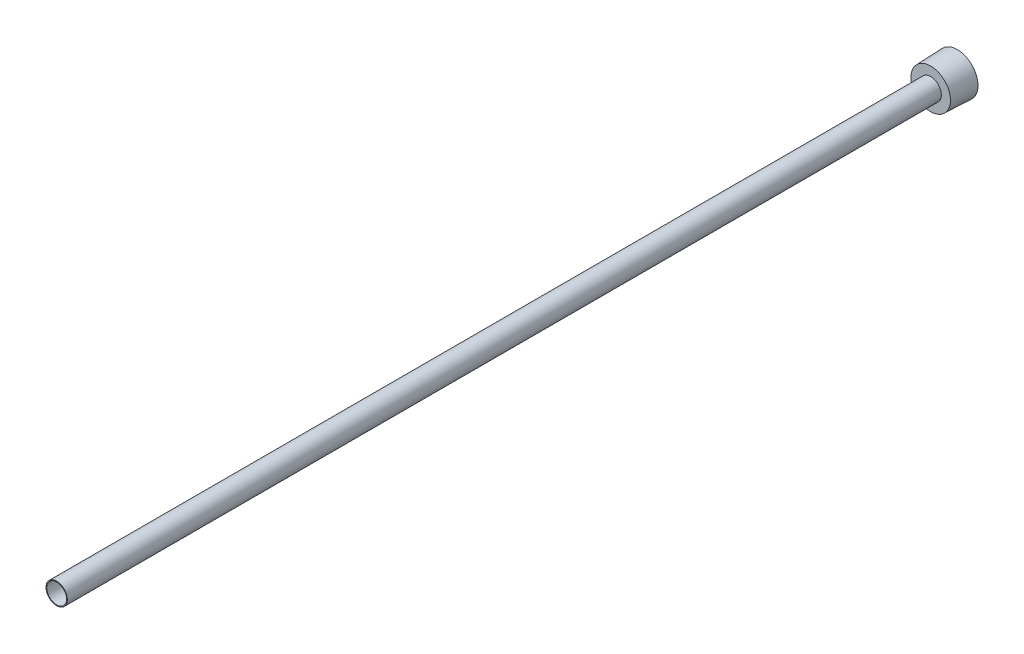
ISO-10303-21;
HEADER;
FILE_DESCRIPTION(('STEP AP214'),'2;1');
FILE_NAME('part.step','',(''),(''),'','','');
FILE_SCHEMA(('AUTOMOTIVE_DESIGN { 1 0 10303 214 1 1 1 1 }'));
ENDSEC;
DATA;
#1=APPLICATION_CONTEXT('core data for automotive mechanical design processes');
#2=APPLICATION_PROTOCOL_DEFINITION('international standard','automotive_design',2000,#1);
#3=PRODUCT_CONTEXT('',#1,'mechanical');
#4=PRODUCT('Part','Part','',(#3));
#5=PRODUCT_RELATED_PRODUCT_CATEGORY('part','',(#4));
#6=PRODUCT_DEFINITION_FORMATION('','',#4);
#7=PRODUCT_DEFINITION_CONTEXT('part definition',#1,'design');
#8=PRODUCT_DEFINITION('design','',#6,#7);
#9=PRODUCT_DEFINITION_SHAPE('','',#8);
#10=(LENGTH_UNIT() NAMED_UNIT(*) SI_UNIT(.MILLI.,.METRE.));
#11=(NAMED_UNIT(*) PLANE_ANGLE_UNIT() SI_UNIT($,.RADIAN.));
#12=(NAMED_UNIT(*) SI_UNIT($,.STERADIAN.) SOLID_ANGLE_UNIT());
#13=UNCERTAINTY_MEASURE_WITH_UNIT(LENGTH_MEASURE(1.E-05),#10,'distance_accuracy_value','');
#14=(GEOMETRIC_REPRESENTATION_CONTEXT(3) GLOBAL_UNCERTAINTY_ASSIGNED_CONTEXT((#13)) GLOBAL_UNIT_ASSIGNED_CONTEXT((#10,
#11,#12)) REPRESENTATION_CONTEXT('',''));
#15=CARTESIAN_POINT('',(0.,0.,0.));
#16=DIRECTION('',(0.,0.,1.));
#17=DIRECTION('',(1.,0.,0.));
#18=AXIS2_PLACEMENT_3D('',#15,#16,#17);
#19=CARTESIAN_POINT('',(0.,0.,0.));
#20=DIRECTION('',(0.,0.,1.));
#21=DIRECTION('',(1.,0.,0.));
#22=AXIS2_PLACEMENT_3D('',#19,#20,#21);
#23=CYLINDRICAL_SURFACE('',#22,5.0419);
#24=CARTESIAN_POINT('',(0.,0.,457.2));
#25=DIRECTION('',(0.,0.,1.));
#26=DIRECTION('',(1.,0.,0.));
#27=AXIS2_PLACEMENT_3D('',#24,#25,#26);
#28=CIRCLE('',#27,5.0419);
#29=CARTESIAN_POINT('',(5.0419,0.,457.2));
#30=VERTEX_POINT('',#29);
#31=EDGE_CURVE('E142',#30,#30,#28,.T.);
#32=ORIENTED_EDGE('',*,*,#31,.T.);
#33=EDGE_LOOP('',(#32));
#34=FACE_BOUND('',#33,.T.);
#35=CARTESIAN_POINT('',(0.,0.,9.525));
#36=DIRECTION('',(0.,0.,-1.));
#37=DIRECTION('',(-1.,0.,0.));
#38=AXIS2_PLACEMENT_3D('',#35,#36,#37);
#39=CIRCLE('',#38,5.0419);
#40=CARTESIAN_POINT('',(-5.0419,0.,9.525));
#41=VERTEX_POINT('',#40);
#42=EDGE_CURVE('E37',#41,#41,#39,.F.);
#43=ORIENTED_EDGE('',*,*,#42,.F.);
#44=EDGE_LOOP('',(#43));
#45=FACE_BOUND('',#44,.T.);
#46=ADVANCED_FACE('F33',(#34,#45),#23,.F.);
#47=CARTESIAN_POINT('',(0.,0.,0.));
#48=DIRECTION('',(0.,0.,1.));
#49=DIRECTION('',(1.,0.,0.));
#50=AXIS2_PLACEMENT_3D('',#47,#48,#49);
#51=PLANE('',#50);
#52=DIRECTION('',(-0.866025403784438,0.5,0.));
#53=VECTOR('',#52,1.);
#54=CARTESIAN_POINT('',(0.,-7.33234841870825,0.));
#55=LINE('',#54,#53);
#56=CARTESIAN_POINT('',(0.,-7.33234841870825,0.));
#57=VERTEX_POINT('',#56);
#58=CARTESIAN_POINT('',(-6.35,-3.66617420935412,0.));
#59=VERTEX_POINT('',#58);
#60=EDGE_CURVE('E124',#57,#59,#55,.T.);
#61=ORIENTED_EDGE('',*,*,#60,.F.);
#62=DIRECTION('',(-0.866025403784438,-0.5,0.));
#63=VECTOR('',#62,1.);
#64=CARTESIAN_POINT('',(6.35,-3.66617420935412,0.));
#65=LINE('',#64,#63);
#66=CARTESIAN_POINT('',(6.35,-3.66617420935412,0.));
#67=VERTEX_POINT('',#66);
#68=EDGE_CURVE('E49',#67,#57,#65,.T.);
#69=ORIENTED_EDGE('',*,*,#68,.F.);
#70=DIRECTION('',(0.,-1.,0.));
#71=VECTOR('',#70,1.);
#72=CARTESIAN_POINT('',(6.35,3.66617420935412,0.));
#73=LINE('',#72,#71);
#74=CARTESIAN_POINT('',(6.35,3.66617420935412,0.));
#75=VERTEX_POINT('',#74);
#76=EDGE_CURVE('E133',#75,#67,#73,.T.);
#77=ORIENTED_EDGE('',*,*,#76,.F.);
#78=DIRECTION('',(0.866025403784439,-0.5,0.));
#79=VECTOR('',#78,1.);
#80=CARTESIAN_POINT('',(0.,7.33234841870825,0.));
#81=LINE('',#80,#79);
#82=CARTESIAN_POINT('',(0.,7.33234841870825,0.));
#83=VERTEX_POINT('',#82);
#84=EDGE_CURVE('E131',#83,#75,#81,.T.);
#85=ORIENTED_EDGE('',*,*,#84,.F.);
#86=DIRECTION('',(0.866025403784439,0.5,0.));
#87=VECTOR('',#86,1.);
#88=CARTESIAN_POINT('',(-6.35,3.66617420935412,0.));
#89=LINE('',#88,#87);
#90=CARTESIAN_POINT('',(-6.35,3.66617420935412,0.));
#91=VERTEX_POINT('',#90);
#92=EDGE_CURVE('E97',#91,#83,#89,.T.);
#93=ORIENTED_EDGE('',*,*,#92,.F.);
#94=DIRECTION('',(0.,1.,0.));
#95=VECTOR('',#94,1.);
#96=CARTESIAN_POINT('',(-6.35,-3.66617420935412,0.));
#97=LINE('',#96,#95);
#98=EDGE_CURVE('E127',#59,#91,#97,.T.);
#99=ORIENTED_EDGE('',*,*,#98,.F.);
#100=EDGE_LOOP('',(#61,#69,#77,#85,#93,#99));
#101=FACE_BOUND('',#100,.T.);
#102=CARTESIAN_POINT('',(0.,0.,0.));
#103=DIRECTION('',(0.,0.,1.));
#104=DIRECTION('',(1.,0.,0.));
#105=AXIS2_PLACEMENT_3D('',#102,#103,#104);
#106=CIRCLE('',#105,10.541);
#107=CARTESIAN_POINT('',(10.541,0.,0.));
#108=VERTEX_POINT('',#107);
#109=EDGE_CURVE('E11',#108,#108,#106,.T.);
#110=ORIENTED_EDGE('',*,*,#109,.F.);
#111=EDGE_LOOP('',(#110));
#112=FACE_BOUND('',#111,.T.);
#113=ADVANCED_FACE('F35',(#101,#112),#51,.F.);
#114=CARTESIAN_POINT('',(0.,0.,0.));
#115=DIRECTION('',(0.,0.,-1.));
#116=DIRECTION('',(-1.,0.,0.));
#117=AXIS2_PLACEMENT_3D('',#114,#115,#116);
#118=CONICAL_SURFACE('',#117,10.541,0.0364599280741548);
#119=CARTESIAN_POINT('',(0.,0.,13.4874));
#120=DIRECTION('',(0.,0.,1.));
#121=DIRECTION('',(1.,0.,0.));
#122=AXIS2_PLACEMENT_3D('',#119,#120,#121);
#123=CIRCLE('',#122,10.0490323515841);
#124=CARTESIAN_POINT('',(10.0490323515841,0.,13.4874));
#125=VERTEX_POINT('',#124);
#126=EDGE_CURVE('E42',#125,#125,#123,.T.);
#127=ORIENTED_EDGE('',*,*,#126,.F.);
#128=EDGE_LOOP('',(#127));
#129=FACE_BOUND('',#128,.T.);
#130=ORIENTED_EDGE('',*,*,#109,.T.);
#131=EDGE_LOOP('',(#130));
#132=FACE_BOUND('',#131,.T.);
#133=ADVANCED_FACE('F156',(#129,#132),#118,.T.);
#134=CARTESIAN_POINT('',(0.,10.0490323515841,13.4874));
#135=DIRECTION('',(0.,0.,-1.));
#136=DIRECTION('',(-1.,0.,0.));
#137=AXIS2_PLACEMENT_3D('',#134,#135,#136);
#138=PLANE('',#137);
#139=CARTESIAN_POINT('',(0.,0.,13.4874));
#140=DIRECTION('',(0.,0.,1.));
#141=DIRECTION('',(1.,0.,0.));
#142=AXIS2_PLACEMENT_3D('',#139,#140,#141);
#143=CIRCLE('',#142,5.4229);
#144=CARTESIAN_POINT('',(5.4229,0.,13.4874));
#145=VERTEX_POINT('',#144);
#146=EDGE_CURVE('E148',#145,#145,#143,.T.);
#147=ORIENTED_EDGE('',*,*,#146,.F.);
#148=EDGE_LOOP('',(#147));
#149=FACE_BOUND('',#148,.T.);
#150=ORIENTED_EDGE('',*,*,#126,.T.);
#151=EDGE_LOOP('',(#150));
#152=FACE_BOUND('',#151,.T.);
#153=ADVANCED_FACE('F154',(#149,#152),#138,.F.);
#154=CARTESIAN_POINT('',(0.,0.,223.212151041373));
#155=DIRECTION('',(0.,0.,1.));
#156=DIRECTION('',(1.,0.,0.));
#157=AXIS2_PLACEMENT_3D('',#154,#155,#156);
#158=CYLINDRICAL_SURFACE('',#157,5.42289999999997);
#159=CARTESIAN_POINT('',(0.,0.,457.2));
#160=DIRECTION('',(0.,0.,1.));
#161=DIRECTION('',(1.,0.,0.));
#162=AXIS2_PLACEMENT_3D('',#159,#160,#161);
#163=CIRCLE('',#162,5.42289999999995);
#164=CARTESIAN_POINT('',(5.42289999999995,0.,457.2));
#165=VERTEX_POINT('',#164);
#166=EDGE_CURVE('E145',#165,#165,#163,.T.);
#167=ORIENTED_EDGE('',*,*,#166,.F.);
#168=EDGE_LOOP('',(#167));
#169=FACE_BOUND('',#168,.T.);
#170=ORIENTED_EDGE('',*,*,#146,.T.);
#171=EDGE_LOOP('',(#170));
#172=FACE_BOUND('',#171,.T.);
#173=ADVANCED_FACE('F190',(#169,#172),#158,.T.);
#174=CARTESIAN_POINT('',(0.,5.42289999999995,457.2));
#175=DIRECTION('',(0.,0.,-1.));
#176=DIRECTION('',(-1.,0.,0.));
#177=AXIS2_PLACEMENT_3D('',#174,#175,#176);
#178=PLANE('',#177);
#179=ORIENTED_EDGE('',*,*,#31,.F.);
#180=EDGE_LOOP('',(#179));
#181=FACE_BOUND('',#180,.T.);
#182=ORIENTED_EDGE('',*,*,#166,.T.);
#183=EDGE_LOOP('',(#182));
#184=FACE_BOUND('',#183,.T.);
#185=ADVANCED_FACE('F183',(#181,#184),#178,.F.);
#186=CARTESIAN_POINT('',(0.,-7.33234841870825,9.525));
#187=DIRECTION('',(0.,0.,-1.));
#188=DIRECTION('',(-1.,0.,0.));
#189=AXIS2_PLACEMENT_3D('',#186,#187,#188);
#190=PLANE('',#189);
#191=DIRECTION('',(-0.866025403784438,-0.5,0.));
#192=VECTOR('',#191,1.);
#193=CARTESIAN_POINT('',(6.35,-3.66617420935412,9.525));
#194=LINE('',#193,#192);
#195=CARTESIAN_POINT('',(6.35,-3.66617420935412,9.525));
#196=VERTEX_POINT('',#195);
#197=CARTESIAN_POINT('',(0.,-7.33234841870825,9.525));
#198=VERTEX_POINT('',#197);
#199=EDGE_CURVE('E135',#196,#198,#194,.T.);
#200=ORIENTED_EDGE('',*,*,#199,.T.);
#201=DIRECTION('',(-0.866025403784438,0.5,0.));
#202=VECTOR('',#201,1.);
#203=CARTESIAN_POINT('',(0.,-7.33234841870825,9.525));
#204=LINE('',#203,#202);
#205=CARTESIAN_POINT('',(-6.35,-3.66617420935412,9.525));
#206=VERTEX_POINT('',#205);
#207=EDGE_CURVE('E118',#198,#206,#204,.T.);
#208=ORIENTED_EDGE('',*,*,#207,.T.);
#209=DIRECTION('',(0.,1.,0.));
#210=VECTOR('',#209,1.);
#211=CARTESIAN_POINT('',(-6.35,-3.66617420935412,9.525));
#212=LINE('',#211,#210);
#213=CARTESIAN_POINT('',(-6.35,3.66617420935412,9.525));
#214=VERTEX_POINT('',#213);
#215=EDGE_CURVE('E116',#206,#214,#212,.T.);
#216=ORIENTED_EDGE('',*,*,#215,.T.);
#217=DIRECTION('',(0.866025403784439,0.5,0.));
#218=VECTOR('',#217,1.);
#219=CARTESIAN_POINT('',(-6.35,3.66617420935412,9.525));
#220=LINE('',#219,#218);
#221=CARTESIAN_POINT('',(0.,7.33234841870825,9.525));
#222=VERTEX_POINT('',#221);
#223=EDGE_CURVE('E94',#214,#222,#220,.T.);
#224=ORIENTED_EDGE('',*,*,#223,.T.);
#225=DIRECTION('',(0.866025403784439,-0.5,0.));
#226=VECTOR('',#225,1.);
#227=CARTESIAN_POINT('',(0.,7.33234841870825,9.525));
#228=LINE('',#227,#226);
#229=CARTESIAN_POINT('',(6.35,3.66617420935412,9.525));
#230=VERTEX_POINT('',#229);
#231=EDGE_CURVE('E105',#222,#230,#228,.T.);
#232=ORIENTED_EDGE('',*,*,#231,.T.);
#233=DIRECTION('',(0.,-1.,0.));
#234=VECTOR('',#233,1.);
#235=CARTESIAN_POINT('',(6.35,3.66617420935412,9.525));
#236=LINE('',#235,#234);
#237=EDGE_CURVE('E109',#230,#196,#236,.T.);
#238=ORIENTED_EDGE('',*,*,#237,.T.);
#239=EDGE_LOOP('',(#200,#208,#216,#224,#232,#238));
#240=FACE_BOUND('',#239,.T.);
#241=ORIENTED_EDGE('',*,*,#42,.T.);
#242=EDGE_LOOP('',(#241));
#243=FACE_BOUND('',#242,.T.);
#244=ADVANCED_FACE('F112',(#240,#243),#190,.T.);
#245=CARTESIAN_POINT('',(6.35,-3.66617420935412,9.525));
#246=DIRECTION('',(0.5,-0.866025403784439,0.));
#247=DIRECTION('',(0.866025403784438,0.5,0.));
#248=AXIS2_PLACEMENT_3D('',#245,#246,#247);
#249=PLANE('',#248);
#250=ORIENTED_EDGE('',*,*,#68,.T.);
#251=DIRECTION('',(0.,0.,-1.));
#252=VECTOR('',#251,1.);
#253=CARTESIAN_POINT('',(0.,-7.33234841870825,9.525));
#254=LINE('',#253,#252);
#255=EDGE_CURVE('E79',#198,#57,#254,.T.);
#256=ORIENTED_EDGE('',*,*,#255,.F.);
#257=ORIENTED_EDGE('',*,*,#199,.F.);
#258=DIRECTION('',(0.,0.,-1.));
#259=VECTOR('',#258,1.);
#260=CARTESIAN_POINT('',(6.35,-3.66617420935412,9.525));
#261=LINE('',#260,#259);
#262=EDGE_CURVE('E57',#196,#67,#261,.T.);
#263=ORIENTED_EDGE('',*,*,#262,.T.);
#264=EDGE_LOOP('',(#250,#256,#257,#263));
#265=FACE_BOUND('',#264,.T.);
#266=ADVANCED_FACE('F174',(#265),#249,.F.);
#267=CARTESIAN_POINT('',(6.35,3.66617420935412,9.525));
#268=DIRECTION('',(1.,0.,0.));
#269=DIRECTION('',(0.,0.,-1.));
#270=AXIS2_PLACEMENT_3D('',#267,#268,#269);
#271=PLANE('',#270);
#272=ORIENTED_EDGE('',*,*,#76,.T.);
#273=ORIENTED_EDGE('',*,*,#262,.F.);
#274=ORIENTED_EDGE('',*,*,#237,.F.);
#275=DIRECTION('',(0.,0.,-1.));
#276=VECTOR('',#275,1.);
#277=CARTESIAN_POINT('',(6.35,3.66617420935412,9.525));
#278=LINE('',#277,#276);
#279=EDGE_CURVE('E101',#230,#75,#278,.T.);
#280=ORIENTED_EDGE('',*,*,#279,.T.);
#281=EDGE_LOOP('',(#272,#273,#274,#280));
#282=FACE_BOUND('',#281,.T.);
#283=ADVANCED_FACE('F176',(#282),#271,.F.);
#284=CARTESIAN_POINT('',(0.,7.33234841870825,9.525));
#285=DIRECTION('',(0.5,0.866025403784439,0.));
#286=DIRECTION('',(-0.866025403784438,0.5,0.));
#287=AXIS2_PLACEMENT_3D('',#284,#285,#286);
#288=PLANE('',#287);
#289=ORIENTED_EDGE('',*,*,#84,.T.);
#290=ORIENTED_EDGE('',*,*,#279,.F.);
#291=ORIENTED_EDGE('',*,*,#231,.F.);
#292=DIRECTION('',(0.,0.,-1.));
#293=VECTOR('',#292,1.);
#294=CARTESIAN_POINT('',(0.,7.33234841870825,9.525));
#295=LINE('',#294,#293);
#296=EDGE_CURVE('E90',#222,#83,#295,.T.);
#297=ORIENTED_EDGE('',*,*,#296,.T.);
#298=EDGE_LOOP('',(#289,#290,#291,#297));
#299=FACE_BOUND('',#298,.T.);
#300=ADVANCED_FACE('F106',(#299),#288,.F.);
#301=CARTESIAN_POINT('',(-6.35,3.66617420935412,9.525));
#302=DIRECTION('',(-0.5,0.866025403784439,0.));
#303=DIRECTION('',(-0.866025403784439,-0.5,0.));
#304=AXIS2_PLACEMENT_3D('',#301,#302,#303);
#305=PLANE('',#304);
#306=ORIENTED_EDGE('',*,*,#92,.T.);
#307=ORIENTED_EDGE('',*,*,#296,.F.);
#308=ORIENTED_EDGE('',*,*,#223,.F.);
#309=DIRECTION('',(0.,0.,-1.));
#310=VECTOR('',#309,1.);
#311=CARTESIAN_POINT('',(-6.35,3.66617420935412,9.525));
#312=LINE('',#311,#310);
#313=EDGE_CURVE('E102',#214,#91,#312,.T.);
#314=ORIENTED_EDGE('',*,*,#313,.T.);
#315=EDGE_LOOP('',(#306,#307,#308,#314));
#316=FACE_BOUND('',#315,.T.);
#317=ADVANCED_FACE('F92',(#316),#305,.F.);
#318=CARTESIAN_POINT('',(-6.35,-3.66617420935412,9.525));
#319=DIRECTION('',(-1.,0.,0.));
#320=DIRECTION('',(0.,-1.,0.));
#321=AXIS2_PLACEMENT_3D('',#318,#319,#320);
#322=PLANE('',#321);
#323=ORIENTED_EDGE('',*,*,#98,.T.);
#324=ORIENTED_EDGE('',*,*,#313,.F.);
#325=ORIENTED_EDGE('',*,*,#215,.F.);
#326=DIRECTION('',(0.,0.,-1.));
#327=VECTOR('',#326,1.);
#328=CARTESIAN_POINT('',(-6.35,-3.66617420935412,9.525));
#329=LINE('',#328,#327);
#330=EDGE_CURVE('E139',#206,#59,#329,.T.);
#331=ORIENTED_EDGE('',*,*,#330,.T.);
#332=EDGE_LOOP('',(#323,#324,#325,#331));
#333=FACE_BOUND('',#332,.T.);
#334=ADVANCED_FACE('F246',(#333),#322,.F.);
#335=CARTESIAN_POINT('',(0.,-7.33234841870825,9.525));
#336=DIRECTION('',(-0.5,-0.866025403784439,0.));
#337=DIRECTION('',(0.866025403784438,-0.5,0.));
#338=AXIS2_PLACEMENT_3D('',#335,#336,#337);
#339=PLANE('',#338);
#340=ORIENTED_EDGE('',*,*,#60,.T.);
#341=ORIENTED_EDGE('',*,*,#330,.F.);
#342=ORIENTED_EDGE('',*,*,#207,.F.);
#343=ORIENTED_EDGE('',*,*,#255,.T.);
#344=EDGE_LOOP('',(#340,#341,#342,#343));
#345=FACE_BOUND('',#344,.T.);
#346=ADVANCED_FACE('F172',(#345),#339,.F.);
#347=CLOSED_SHELL('',(#46,#113,#133,#153,#173,#185,#244,#266,#283,#300,#317,#334,#346));
#348=MANIFOLD_SOLID_BREP('B2',#347);
#349=ADVANCED_BREP_SHAPE_REPRESENTATION('',(#18,#348),#14);
#350=SHAPE_DEFINITION_REPRESENTATION(#9,#349);
ENDSEC;
END-ISO-10303-21;
